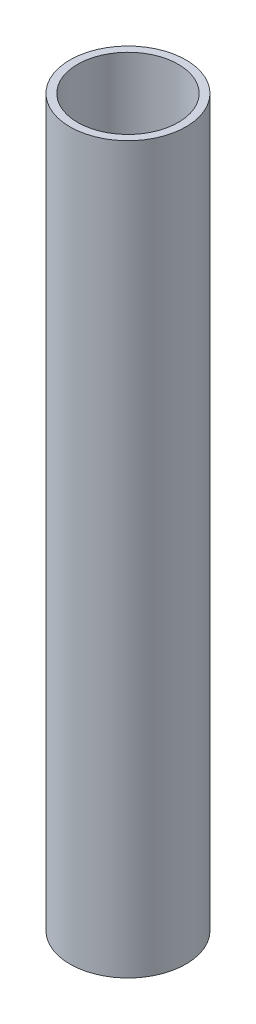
ISO-10303-21;
HEADER;
FILE_DESCRIPTION(('STEP AP214'),'2;1');
FILE_NAME('part.step','',(''),(''),'','','');
FILE_SCHEMA(('AUTOMOTIVE_DESIGN { 1 0 10303 214 1 1 1 1 }'));
ENDSEC;
DATA;
#1=APPLICATION_CONTEXT('core data for automotive mechanical design processes');
#2=APPLICATION_PROTOCOL_DEFINITION('international standard','automotive_design',2000,#1);
#3=PRODUCT_CONTEXT('',#1,'mechanical');
#4=PRODUCT('Part','Part','',(#3));
#5=PRODUCT_RELATED_PRODUCT_CATEGORY('part','',(#4));
#6=PRODUCT_DEFINITION_FORMATION('','',#4);
#7=PRODUCT_DEFINITION_CONTEXT('part definition',#1,'design');
#8=PRODUCT_DEFINITION('design','',#6,#7);
#9=PRODUCT_DEFINITION_SHAPE('','',#8);
#10=(LENGTH_UNIT() NAMED_UNIT(*) SI_UNIT(.MILLI.,.METRE.));
#11=(NAMED_UNIT(*) PLANE_ANGLE_UNIT() SI_UNIT($,.RADIAN.));
#12=(NAMED_UNIT(*) SI_UNIT($,.STERADIAN.) SOLID_ANGLE_UNIT());
#13=UNCERTAINTY_MEASURE_WITH_UNIT(LENGTH_MEASURE(1.E-05),#10,'distance_accuracy_value','');
#14=(GEOMETRIC_REPRESENTATION_CONTEXT(3) GLOBAL_UNCERTAINTY_ASSIGNED_CONTEXT((#13)) GLOBAL_UNIT_ASSIGNED_CONTEXT((#10,
#11,#12)) REPRESENTATION_CONTEXT('',''));
#15=CARTESIAN_POINT('',(0.,0.,0.));
#16=DIRECTION('',(0.,0.,1.));
#17=DIRECTION('',(1.,0.,0.));
#18=AXIS2_PLACEMENT_3D('',#15,#16,#17);
#19=CARTESIAN_POINT('',(0.,190.,0.));
#20=DIRECTION('',(0.,1.,0.));
#21=DIRECTION('',(0.,0.,1.));
#22=AXIS2_PLACEMENT_3D('',#19,#20,#21);
#23=PLANE('',#22);
#24=CARTESIAN_POINT('',(0.,190.,0.));
#25=DIRECTION('',(0.,1.,0.));
#26=DIRECTION('',(0.,0.,1.));
#27=AXIS2_PLACEMENT_3D('',#24,#25,#26);
#28=CIRCLE('',#27,15.2);
#29=CARTESIAN_POINT('',(0.,190.,15.2));
#30=VERTEX_POINT('',#29);
#31=EDGE_CURVE('E10',#30,#30,#28,.T.);
#32=ORIENTED_EDGE('',*,*,#31,.T.);
#33=EDGE_LOOP('',(#32));
#34=FACE_BOUND('',#33,.T.);
#35=CARTESIAN_POINT('',(0.,190.,0.));
#36=DIRECTION('',(0.,1.,0.));
#37=DIRECTION('',(0.,0.,1.));
#38=AXIS2_PLACEMENT_3D('',#35,#36,#37);
#39=CIRCLE('',#38,13.2);
#40=CARTESIAN_POINT('',(0.,190.,13.2));
#41=VERTEX_POINT('',#40);
#42=EDGE_CURVE('E35',#41,#41,#39,.T.);
#43=ORIENTED_EDGE('',*,*,#42,.F.);
#44=EDGE_LOOP('',(#43));
#45=FACE_BOUND('',#44,.T.);
#46=ADVANCED_FACE('F24',(#34,#45),#23,.T.);
#47=CARTESIAN_POINT('',(0.,0.,0.));
#48=DIRECTION('',(0.,1.,0.));
#49=DIRECTION('',(0.,0.,1.));
#50=AXIS2_PLACEMENT_3D('',#47,#48,#49);
#51=PLANE('',#50);
#52=CARTESIAN_POINT('',(0.,0.,0.));
#53=DIRECTION('',(0.,1.,0.));
#54=DIRECTION('',(0.,0.,1.));
#55=AXIS2_PLACEMENT_3D('',#52,#53,#54);
#56=CIRCLE('',#55,15.2);
#57=CARTESIAN_POINT('',(0.,0.,15.2));
#58=VERTEX_POINT('',#57);
#59=EDGE_CURVE('E31',#58,#58,#56,.T.);
#60=ORIENTED_EDGE('',*,*,#59,.F.);
#61=EDGE_LOOP('',(#60));
#62=FACE_BOUND('',#61,.T.);
#63=CARTESIAN_POINT('',(0.,0.,0.));
#64=DIRECTION('',(0.,1.,0.));
#65=DIRECTION('',(0.,0.,1.));
#66=AXIS2_PLACEMENT_3D('',#63,#64,#65);
#67=CIRCLE('',#66,13.2);
#68=CARTESIAN_POINT('',(0.,0.,13.2));
#69=VERTEX_POINT('',#68);
#70=EDGE_CURVE('E39',#69,#69,#67,.T.);
#71=ORIENTED_EDGE('',*,*,#70,.T.);
#72=EDGE_LOOP('',(#71));
#73=FACE_BOUND('',#72,.T.);
#74=ADVANCED_FACE('F45',(#62,#73),#51,.F.);
#75=CARTESIAN_POINT('',(0.,190.,0.));
#76=DIRECTION('',(0.,-1.,0.));
#77=DIRECTION('',(0.,0.,-1.));
#78=AXIS2_PLACEMENT_3D('',#75,#76,#77);
#79=CYLINDRICAL_SURFACE('',#78,15.2);
#80=ORIENTED_EDGE('',*,*,#31,.F.);
#81=EDGE_LOOP('',(#80));
#82=FACE_BOUND('',#81,.T.);
#83=ORIENTED_EDGE('',*,*,#59,.T.);
#84=EDGE_LOOP('',(#83));
#85=FACE_BOUND('',#84,.T.);
#86=ADVANCED_FACE('F26',(#82,#85),#79,.T.);
#87=CARTESIAN_POINT('',(0.,190.,0.));
#88=DIRECTION('',(0.,-1.,0.));
#89=DIRECTION('',(0.,0.,-1.));
#90=AXIS2_PLACEMENT_3D('',#87,#88,#89);
#91=CYLINDRICAL_SURFACE('',#90,13.2);
#92=ORIENTED_EDGE('',*,*,#42,.T.);
#93=EDGE_LOOP('',(#92));
#94=FACE_BOUND('',#93,.T.);
#95=ORIENTED_EDGE('',*,*,#70,.F.);
#96=EDGE_LOOP('',(#95));
#97=FACE_BOUND('',#96,.T.);
#98=ADVANCED_FACE('F47',(#94,#97),#91,.F.);
#99=CLOSED_SHELL('',(#46,#74,#86,#98));
#100=MANIFOLD_SOLID_BREP('B2',#99);
#101=ADVANCED_BREP_SHAPE_REPRESENTATION('',(#18,#100),#14);
#102=SHAPE_DEFINITION_REPRESENTATION(#9,#101);
ENDSEC;
END-ISO-10303-21;
